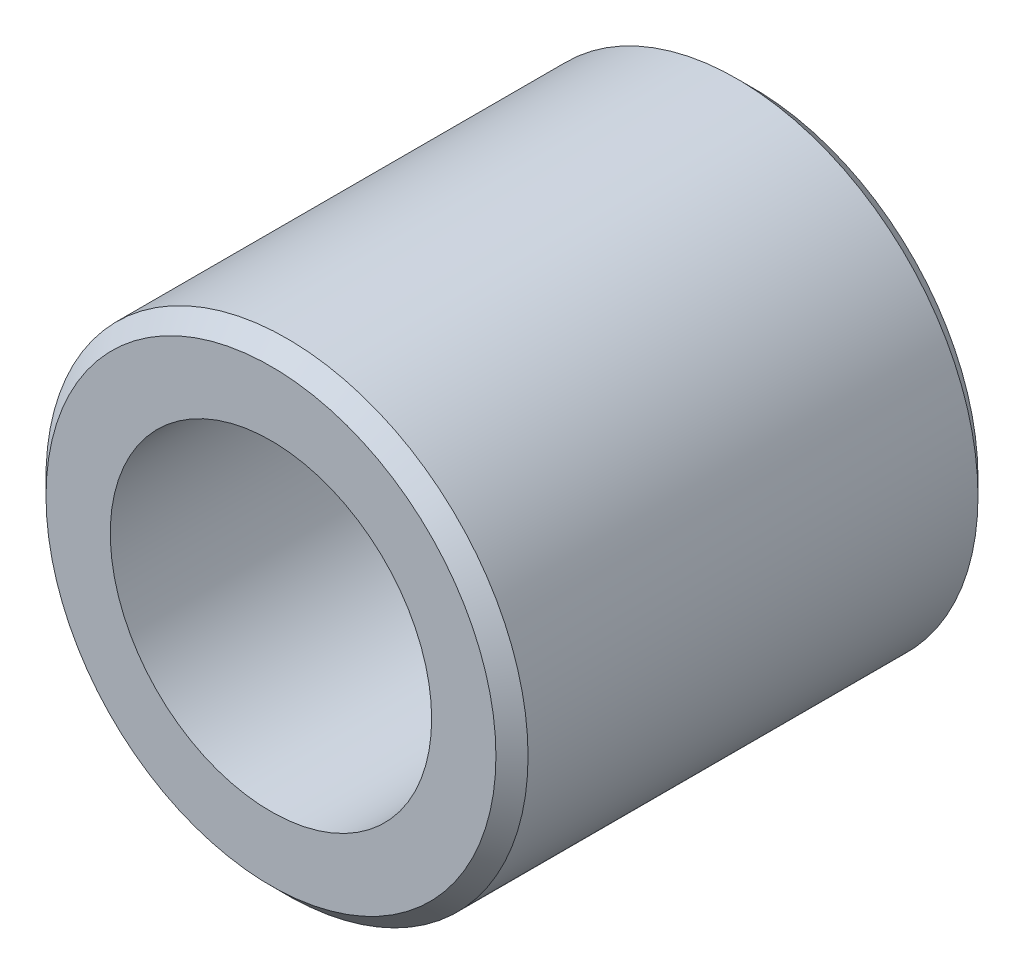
from build123d import *

# Parameters (mm, degrees)
SKETCH1_R           = 15
SKETCH1_R_2         = 10
BOSS_EXTRUDE1_DEPTH = 30
CHAMFER1_SIZE       = 1
SCALE1_SCALE        = 0.75


with BuildPart() as part:
    # Sketch1 → Boss-Extrude1 (new body)
    with BuildSketch(Plane.XY):
        Circle(SKETCH1_R)
        Circle(SKETCH1_R_2, mode=Mode.SUBTRACT)
    extrude(amount=BOSS_EXTRUDE1_DEPTH)

    # Chamfer1
    chamfer1_edges = [part.edges().sort_by_distance(p)[0] for p in [
        (-15, 0, 0),
        (-15, 0, 30),
    ]]
    chamfer(chamfer1_edges, length=CHAMFER1_SIZE)


with BuildPart() as part_1:
    # Scale1: scaled about (0, 0, 15)
    add(part.part.scale(SCALE1_SCALE).moved(Location((0, 0, 3.75))))


solid = part_1.part
